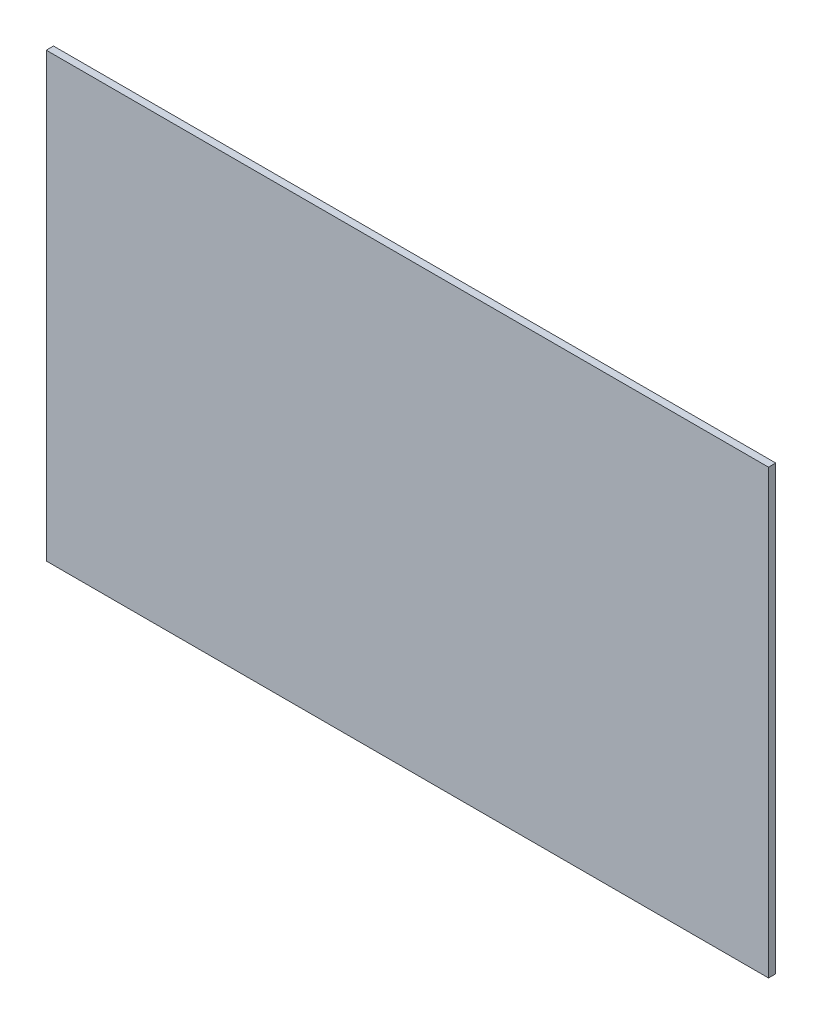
from build123d import *

# Parameters (mm, degrees)
SKETCH2_W           = 120
SKETCH2_H           = 73.5
BOSS_EXTRUDE1_DEPTH = 1.2


with BuildPart() as part:
    # Sketch2 → Boss-Extrude1 (new body)
    with BuildSketch(Plane.XY):
        Rectangle(SKETCH2_W, SKETCH2_H)
    extrude(amount=BOSS_EXTRUDE1_DEPTH)


solid = part.part
